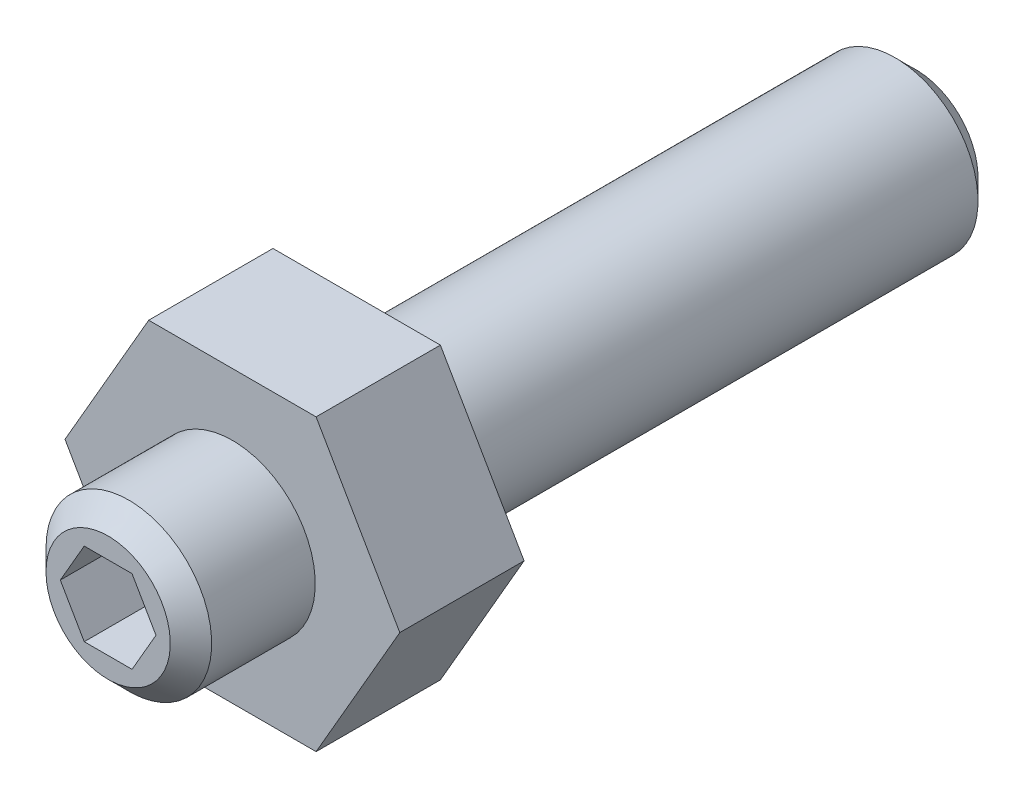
from build123d import *

# Parameters (mm, degrees)
EXTRUSION1_DEPTH        = 3
EXTRUSION2_DEPTH        = 13.5
EXTRUSION2_DEPTH_BACK   = 6
ESQUISSE2_R             = 2
CHANFREIN1_SIZE         = 0.5
ENL_V_MAT_EXTRU_1_DEPTH = 4


with BuildPart() as part:
    # Esquisse1 → Extrusion1 (new body)
    with BuildSketch(Plane.XY):
        Polygon((4.041451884, 0), (2.020725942, 3.5), (-2.020725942, 3.5), (-4.041451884, 0), (-2.020725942, -3.5), (2.020725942, -3.5), align=None)
    extrude(amount=EXTRUSION1_DEPTH)

    # Esquisse2 → Extrusion2 (add, two sides: drawn at the far end of the back side and taken through both)
    with BuildSketch(Plane(origin=(0, 0, 0), x_dir=(-1, 0, 0), z_dir=(0, 0, -1)).offset(-EXTRUSION2_DEPTH_BACK)):
        Circle(ESQUISSE2_R)
    extrude(amount=EXTRUSION2_DEPTH + EXTRUSION2_DEPTH_BACK)

    # Chanfrein1
    chanfrein1_edges = [part.edges().sort_by_distance(p)[0] for p in [
        (2, 0, 6),
        (2, 0, -13.5),
    ]]
    chamfer(chanfrein1_edges, length=CHANFREIN1_SIZE)

    # Esquisse3 → Enl_v. mat.-Extru.1 (cut)
    with BuildSketch(Plane.XY.offset(6)):
        Polygon((1.154700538, 0), (0.577350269, 1), (-0.577350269, 1), (-1.154700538, 0), (-0.577350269, -1), (0.577350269, -1), align=None)
    extrude(amount=-ENL_V_MAT_EXTRU_1_DEPTH, mode=Mode.SUBTRACT)


solid = part.part
